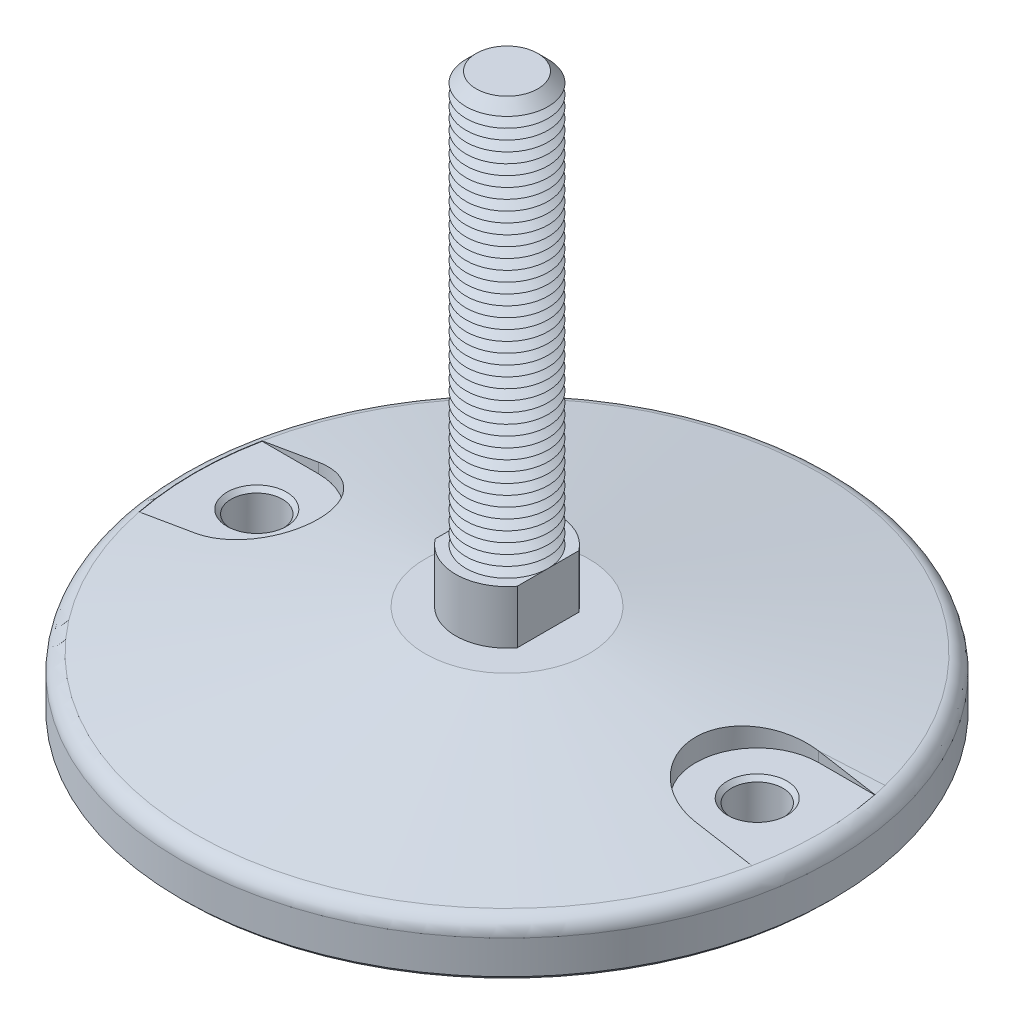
from build123d import *

# Parameters (mm, degrees)
FILLET1_R                = 4
SKETCH3_R                = 12.5
BOSS_EXTRUDE1_DEPTH      = 13
CUT_EXTRUDE1_START       = -13
CUT_EXTRUDE1_DEPTH       = 13
SKETCH5_R                = 10
BOSS_EXTRUDE2_DEPTH      = 100
CHAMFER1_SIZE            = 2.5
LPATTERN1_COUNT          = 39
LPATTERN1_PITCH          = 2.5
CUT_EXTRUDE4_DEPTH       = 10
SKETCH10_R               = 6.25
CUT_EXTRUDE5_DEPTH       = 13
CHAMFER2_SIZE            = 1
CHAMFER2_OF_MIRROR1_SIZE = 1
CHAMFER3_SIZE            = 1


with BuildPart() as part:
    # Sketch2 → Revolve1 (revolve)
    with BuildSketch(Plane(origin=(0, 0, 0), x_dir=(0, 0, -1), z_dir=(1, 0, 0)), mode=Mode.PRIVATE) as revolve1_sk:
        Polygon((0, 0), (-20, 0), (-79.5, -10.491455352), (-79.5, -23), (0, -23), align=None)
    revolve(revolve1_sk.sketch.rotate(Axis((0, 61.338865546, 0), (0, -1, 0)), 180), axis=Axis((0, 61.338865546, 0), (0, -1, 0)))

    # Fillet1
    fillet1_edges = [part.edges().sort_by_distance(p)[0] for p in [
        (0, -10.491455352, 79.5),
    ]]
    fillet(fillet1_edges, radius=FILLET1_R)

    # Sketch3 → Boss-Extrude1 (add)
    with BuildSketch(Plane(origin=(0, 0, 0), x_dir=(1, 0, 0), z_dir=(0, 1, 0))):
        with Locations(Location((0, 0, 0), (0, 0, 90))):
            Circle(SKETCH3_R)
    extrude(amount=BOSS_EXTRUDE1_DEPTH)

    # Sketch4 → Cut-Extrude1 (cut)
    with BuildSketch(Plane(origin=(0, 13, 0), x_dir=(1, 0, 0), z_dir=(0, 1, 0)).offset(CUT_EXTRUDE1_START)):
        with BuildLine():
            Line((-10, 7.5), (-10, -7.5))
            ThreePointArc((-10, -7.5), (-12.5, 0), (-10, 7.5))
        make_face()
        with BuildLine():
            Line((10, -7.5), (10, 7.5))
            ThreePointArc((10, 7.5), (12.5, 0), (10, -7.5))
        make_face()
    extrude(amount=CUT_EXTRUDE1_DEPTH, mode=Mode.SUBTRACT)

    # Sketch5 → Boss-Extrude2 (add)
    with BuildSketch(Plane(origin=(0, 13, 0), x_dir=(1, 0, 0), z_dir=(0, 1, 0))):
        with Locations(Location((0, 0, 0), (0, 0, 180))):
            Circle(SKETCH5_R)
    extrude(amount=BOSS_EXTRUDE2_DEPTH)

    # Chamfer1
    chamfer1_edges = [part.edges().sort_by_distance(p)[0] for p in [
        (10, 113, 0),
    ]]
    chamfer(chamfer1_edges, length=CHAMFER1_SIZE)

    # Sketch6 → Cut-Revolve1 (revolve, cut)
    with BuildSketch(Plane(origin=(0, 0, 0), x_dir=(0, 0, -1), z_dir=(1, 0, 0))):
        Polygon((-10, 13), (-7.834936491, 14.25), (-10, 15.5), align=None)
    cut_revolve1 = revolve(axis=Axis((0, 61.338865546, 0), (0, -1, 0)), mode=Mode.SUBTRACT)

    # LPattern1: Cut-Revolve1 ×39
    with Locations(*[(0, i * LPATTERN1_PITCH, 0) for i in range(1, LPATTERN1_COUNT)]):
        add(cut_revolve1, mode=Mode.SUBTRACT)

    # Sketch8 → Cut-Extrude4 (cut)
    with BuildSketch(Plane(origin=(0, 0, 0), x_dir=(1, 0, 0), z_dir=(0, 1, 0))):
        with BuildLine():
            Line((-61, 15), (-74.703520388, 15))
            ThreePointArc((-74.703520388, 15), (-76.194592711, 0), (-74.703520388, -15))
            Line((-74.703520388, -15), (-61, -15))
            ThreePointArc((-61, -15), (-46, 0), (-61, 15))
        make_face()
    cut_extrude4 = extrude(amount=-CUT_EXTRUDE4_DEPTH, mode=Mode.SUBTRACT)

    # Sketch10 → Cut-Extrude5 (cut)
    with BuildSketch(Plane(origin=(0, -10, 0), x_dir=(1, 0, 0), z_dir=(0, 1, 0))):
        with Locations(Location((-61, 0, 0), (0, 0, 270))):
            Circle(SKETCH10_R)
    cut_extrude5 = extrude(amount=-CUT_EXTRUDE5_DEPTH, mode=Mode.SUBTRACT)

    # Chamfer2
    chamfer2_edges = [part.edges().sort_by_distance(p)[0] for p in [
        (-61, -10, -6.25),
        (-61, -23, -6.25),
    ]]
    chamfer(chamfer2_edges, length=CHAMFER2_SIZE)

    # Mirror1: Cut-Extrude4, Cut-Extrude5 across plane
    add(cut_extrude4.mirror(Plane(origin=(0, 0, 0), x_dir=(0, 0, 1), z_dir=(1, 0, 0))), mode=Mode.SUBTRACT)
    add(cut_extrude5.mirror(Plane(origin=(0, 0, 0), x_dir=(0, 0, 1), z_dir=(1, 0, 0))), mode=Mode.SUBTRACT)

    # Chamfer2 of Mirror1
    chamfer2_of_mirror1_edges = [part.edges().sort_by_distance(p)[0] for p in [
        (61, -10, -6.25),
        (61, -23, -6.25),
    ]]
    chamfer(chamfer2_of_mirror1_edges, length=CHAMFER2_OF_MIRROR1_SIZE)

    # Chamfer3
    chamfer3_edges = [part.edges().sort_by_distance(p)[0] for p in [
        (0, -23, 79.5),
    ]]
    chamfer(chamfer3_edges, length=CHAMFER3_SIZE)


solid = part.part
